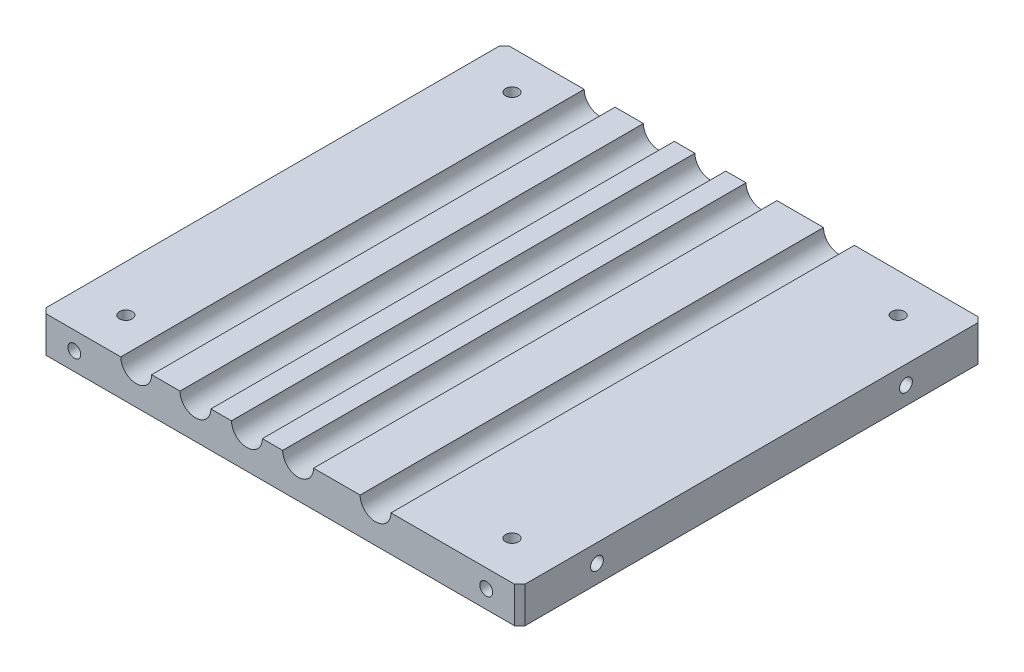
ISO-10303-21;
HEADER;
FILE_DESCRIPTION(('STEP AP214'),'2;1');
FILE_NAME('part.step','',(''),(''),'','','');
FILE_SCHEMA(('AUTOMOTIVE_DESIGN { 1 0 10303 214 1 1 1 1 }'));
ENDSEC;
DATA;
#1=APPLICATION_CONTEXT('core data for automotive mechanical design processes');
#2=APPLICATION_PROTOCOL_DEFINITION('international standard','automotive_design',2000,#1);
#3=PRODUCT_CONTEXT('',#1,'mechanical');
#4=PRODUCT('Part','Part','',(#3));
#5=PRODUCT_RELATED_PRODUCT_CATEGORY('part','',(#4));
#6=PRODUCT_DEFINITION_FORMATION('','',#4);
#7=PRODUCT_DEFINITION_CONTEXT('part definition',#1,'design');
#8=PRODUCT_DEFINITION('design','',#6,#7);
#9=PRODUCT_DEFINITION_SHAPE('','',#8);
#10=(LENGTH_UNIT() NAMED_UNIT(*) SI_UNIT(.MILLI.,.METRE.));
#11=(NAMED_UNIT(*) PLANE_ANGLE_UNIT() SI_UNIT($,.RADIAN.));
#12=(NAMED_UNIT(*) SI_UNIT($,.STERADIAN.) SOLID_ANGLE_UNIT());
#13=UNCERTAINTY_MEASURE_WITH_UNIT(LENGTH_MEASURE(1.E-05),#10,'distance_accuracy_value','');
#14=(GEOMETRIC_REPRESENTATION_CONTEXT(3) GLOBAL_UNCERTAINTY_ASSIGNED_CONTEXT((#13)) GLOBAL_UNIT_ASSIGNED_CONTEXT((#10,
#11,#12)) REPRESENTATION_CONTEXT('',''));
#15=CARTESIAN_POINT('',(0.,0.,0.));
#16=DIRECTION('',(0.,0.,1.));
#17=DIRECTION('',(1.,0.,0.));
#18=AXIS2_PLACEMENT_3D('',#15,#16,#17);
#19=CARTESIAN_POINT('',(0.,0.,0.));
#20=DIRECTION('',(0.,1.,0.));
#21=DIRECTION('',(0.,0.,1.));
#22=AXIS2_PLACEMENT_3D('',#19,#20,#21);
#23=PLANE('',#22);
#24=CARTESIAN_POINT('',(-37.5,0.,-37.5));
#25=DIRECTION('',(0.,-1.,0.));
#26=DIRECTION('',(0.,0.,-1.));
#27=AXIS2_PLACEMENT_3D('',#24,#25,#26);
#28=CIRCLE('',#27,1.24999999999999);
#29=CARTESIAN_POINT('',(-37.5,0.,-38.75));
#30=VERTEX_POINT('',#29);
#31=EDGE_CURVE('E263',#30,#30,#28,.T.);
#32=ORIENTED_EDGE('',*,*,#31,.F.);
#33=EDGE_LOOP('',(#32));
#34=FACE_BOUND('',#33,.T.);
#35=CARTESIAN_POINT('',(37.5,0.,-37.5));
#36=DIRECTION('',(0.,-1.,0.));
#37=DIRECTION('',(0.,0.,-1.));
#38=AXIS2_PLACEMENT_3D('',#35,#36,#37);
#39=CIRCLE('',#38,1.24999999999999);
#40=CARTESIAN_POINT('',(37.5,0.,-38.75));
#41=VERTEX_POINT('',#40);
#42=EDGE_CURVE('E271',#41,#41,#39,.T.);
#43=ORIENTED_EDGE('',*,*,#42,.F.);
#44=EDGE_LOOP('',(#43));
#45=FACE_BOUND('',#44,.T.);
#46=CARTESIAN_POINT('',(37.5,0.,37.5));
#47=DIRECTION('',(0.,-1.,0.));
#48=DIRECTION('',(0.,0.,-1.));
#49=AXIS2_PLACEMENT_3D('',#46,#47,#48);
#50=CIRCLE('',#49,1.24999999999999);
#51=CARTESIAN_POINT('',(37.5,0.,36.25));
#52=VERTEX_POINT('',#51);
#53=EDGE_CURVE('E279',#52,#52,#50,.T.);
#54=ORIENTED_EDGE('',*,*,#53,.F.);
#55=EDGE_LOOP('',(#54));
#56=FACE_BOUND('',#55,.T.);
#57=DIRECTION('',(-1.,0.,0.));
#58=VECTOR('',#57,1.);
#59=CARTESIAN_POINT('',(-46.5,0.,-45.));
#60=LINE('',#59,#58);
#61=CARTESIAN_POINT('',(45.5,0.,-45.));
#62=VERTEX_POINT('',#61);
#63=CARTESIAN_POINT('',(-45.5,0.,-45.));
#64=VERTEX_POINT('',#63);
#65=EDGE_CURVE('E367',#62,#64,#60,.T.);
#66=ORIENTED_EDGE('',*,*,#65,.F.);
#67=DIRECTION('',(-0.707106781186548,0.,-0.707106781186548));
#68=VECTOR('',#67,1.);
#69=CARTESIAN_POINT('',(45.5,0.,-45.));
#70=LINE('',#69,#68);
#71=CARTESIAN_POINT('',(46.5,0.,-44.));
#72=VERTEX_POINT('',#71);
#73=EDGE_CURVE('E394',#62,#72,#70,.F.);
#74=ORIENTED_EDGE('',*,*,#73,.T.);
#75=DIRECTION('',(0.,0.,-1.));
#76=VECTOR('',#75,1.);
#77=CARTESIAN_POINT('',(46.5,0.,-45.));
#78=LINE('',#77,#76);
#79=CARTESIAN_POINT('',(46.5,0.,44.));
#80=VERTEX_POINT('',#79);
#81=EDGE_CURVE('E338',#80,#72,#78,.T.);
#82=ORIENTED_EDGE('',*,*,#81,.F.);
#83=DIRECTION('',(0.707106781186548,0.,-0.707106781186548));
#84=VECTOR('',#83,1.);
#85=CARTESIAN_POINT('',(46.5,0.,44.));
#86=LINE('',#85,#84);
#87=CARTESIAN_POINT('',(45.5,0.,45.));
#88=VERTEX_POINT('',#87);
#89=EDGE_CURVE('E385',#80,#88,#86,.F.);
#90=ORIENTED_EDGE('',*,*,#89,.T.);
#91=DIRECTION('',(1.,0.,0.));
#92=VECTOR('',#91,1.);
#93=CARTESIAN_POINT('',(-46.5,0.,45.));
#94=LINE('',#93,#92);
#95=CARTESIAN_POINT('',(-45.5,0.,45.));
#96=VERTEX_POINT('',#95);
#97=EDGE_CURVE('E346',#96,#88,#94,.T.);
#98=ORIENTED_EDGE('',*,*,#97,.F.);
#99=DIRECTION('',(0.707106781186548,0.,0.707106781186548));
#100=VECTOR('',#99,1.);
#101=CARTESIAN_POINT('',(-45.5,0.,45.));
#102=LINE('',#101,#100);
#103=CARTESIAN_POINT('',(-46.5,0.,44.));
#104=VERTEX_POINT('',#103);
#105=EDGE_CURVE('E388',#96,#104,#102,.F.);
#106=ORIENTED_EDGE('',*,*,#105,.T.);
#107=DIRECTION('',(0.,0.,1.));
#108=VECTOR('',#107,1.);
#109=CARTESIAN_POINT('',(-46.5,0.,-45.));
#110=LINE('',#109,#108);
#111=CARTESIAN_POINT('',(-46.5,0.,-44.));
#112=VERTEX_POINT('',#111);
#113=EDGE_CURVE('E371',#112,#104,#110,.T.);
#114=ORIENTED_EDGE('',*,*,#113,.F.);
#115=DIRECTION('',(-0.707106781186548,0.,0.707106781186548));
#116=VECTOR('',#115,1.);
#117=CARTESIAN_POINT('',(-46.5,0.,-44.));
#118=LINE('',#117,#116);
#119=EDGE_CURVE('E391',#112,#64,#118,.F.);
#120=ORIENTED_EDGE('',*,*,#119,.T.);
#121=EDGE_LOOP('',(#66,#74,#82,#90,#98,#106,#114,#120));
#122=FACE_BOUND('',#121,.T.);
#123=CARTESIAN_POINT('',(-37.5,0.,37.5));
#124=DIRECTION('',(0.,-1.,0.));
#125=DIRECTION('',(0.,0.,-1.));
#126=AXIS2_PLACEMENT_3D('',#123,#124,#125);
#127=CIRCLE('',#126,1.24999999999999);
#128=CARTESIAN_POINT('',(-37.5,0.,36.25));
#129=VERTEX_POINT('',#128);
#130=EDGE_CURVE('E287',#129,#129,#127,.T.);
#131=ORIENTED_EDGE('',*,*,#130,.F.);
#132=EDGE_LOOP('',(#131));
#133=FACE_BOUND('',#132,.T.);
#134=ADVANCED_FACE('F42',(#34,#45,#56,#122,#133),#23,.F.);
#135=CARTESIAN_POINT('',(0.,7.,0.));
#136=DIRECTION('',(0.,1.,0.));
#137=DIRECTION('',(0.,0.,1.));
#138=AXIS2_PLACEMENT_3D('',#135,#136,#137);
#139=PLANE('',#138);
#140=DIRECTION('',(0.,0.,1.));
#141=VECTOR('',#140,1.);
#142=CARTESIAN_POINT('',(0.459737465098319,7.,-45.));
#143=LINE('',#142,#141);
#144=CARTESIAN_POINT('',(0.459737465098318,7.,-45.));
#145=VERTEX_POINT('',#144);
#146=CARTESIAN_POINT('',(0.459737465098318,7.,45.));
#147=VERTEX_POINT('',#146);
#148=EDGE_CURVE('E58',#145,#147,#143,.T.);
#149=ORIENTED_EDGE('',*,*,#148,.F.);
#150=DIRECTION('',(-1.,0.,0.));
#151=VECTOR('',#150,1.);
#152=CARTESIAN_POINT('',(-46.5,7.,-45.));
#153=LINE('',#152,#151);
#154=CARTESIAN_POINT('',(-3.48000000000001,7.,-45.));
#155=VERTEX_POINT('',#154);
#156=EDGE_CURVE('E503',#145,#155,#153,.T.);
#157=ORIENTED_EDGE('',*,*,#156,.T.);
#158=DIRECTION('',(0.,0.,1.));
#159=VECTOR('',#158,1.);
#160=CARTESIAN_POINT('',(-3.48000000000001,7.,-45.));
#161=LINE('',#160,#159);
#162=CARTESIAN_POINT('',(-3.48000000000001,7.,45.));
#163=VERTEX_POINT('',#162);
#164=EDGE_CURVE('E323',#163,#155,#161,.F.);
#165=ORIENTED_EDGE('',*,*,#164,.F.);
#166=DIRECTION('',(1.,0.,0.));
#167=VECTOR('',#166,1.);
#168=CARTESIAN_POINT('',(-46.5,7.,45.));
#169=LINE('',#168,#167);
#170=EDGE_CURVE('E454',#163,#147,#169,.T.);
#171=ORIENTED_EDGE('',*,*,#170,.T.);
#172=EDGE_LOOP('',(#149,#157,#165,#171));
#173=FACE_BOUND('',#172,.T.);
#174=ADVANCED_FACE('F551',(#173),#139,.T.);
#175=DIRECTION('',(0.,0.,1.));
#176=VECTOR('',#175,1.);
#177=CARTESIAN_POINT('',(-9.48000000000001,7.,-45.));
#178=LINE('',#177,#176);
#179=CARTESIAN_POINT('',(-9.48000000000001,7.,-45.));
#180=VERTEX_POINT('',#179);
#181=CARTESIAN_POINT('',(-9.48000000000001,7.,45.));
#182=VERTEX_POINT('',#181);
#183=EDGE_CURVE('E65',#180,#182,#178,.T.);
#184=ORIENTED_EDGE('',*,*,#183,.F.);
#185=CARTESIAN_POINT('',(-13.48,7.,-45.));
#186=VERTEX_POINT('',#185);
#187=EDGE_CURVE('E506',#180,#186,#153,.T.);
#188=ORIENTED_EDGE('',*,*,#187,.T.);
#189=DIRECTION('',(0.,0.,1.));
#190=VECTOR('',#189,1.);
#191=CARTESIAN_POINT('',(-13.48,7.,-45.));
#192=LINE('',#191,#190);
#193=CARTESIAN_POINT('',(-13.48,7.,45.));
#194=VERTEX_POINT('',#193);
#195=EDGE_CURVE('E317',#194,#186,#192,.F.);
#196=ORIENTED_EDGE('',*,*,#195,.F.);
#197=EDGE_CURVE('E452',#194,#182,#169,.T.);
#198=ORIENTED_EDGE('',*,*,#197,.T.);
#199=EDGE_LOOP('',(#184,#188,#196,#198));
#200=FACE_BOUND('',#199,.T.);
#201=ADVANCED_FACE('F458',(#200),#139,.T.);
#202=DIRECTION('',(0.,0.,1.));
#203=VECTOR('',#202,1.);
#204=CARTESIAN_POINT('',(-19.48,7.,-45.));
#205=LINE('',#204,#203);
#206=CARTESIAN_POINT('',(-19.48,7.,-45.));
#207=VERTEX_POINT('',#206);
#208=CARTESIAN_POINT('',(-19.48,7.,45.));
#209=VERTEX_POINT('',#208);
#210=EDGE_CURVE('E320',#207,#209,#205,.T.);
#211=ORIENTED_EDGE('',*,*,#210,.F.);
#212=CARTESIAN_POINT('',(-24.9800000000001,7.,-45.));
#213=VERTEX_POINT('',#212);
#214=EDGE_CURVE('E508',#207,#213,#153,.T.);
#215=ORIENTED_EDGE('',*,*,#214,.T.);
#216=DIRECTION('',(0.,0.,1.));
#217=VECTOR('',#216,1.);
#218=CARTESIAN_POINT('',(-24.9800000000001,7.,-45.));
#219=LINE('',#218,#217);
#220=CARTESIAN_POINT('',(-24.9800000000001,7.,45.));
#221=VERTEX_POINT('',#220);
#222=EDGE_CURVE('E300',#221,#213,#219,.F.);
#223=ORIENTED_EDGE('',*,*,#222,.F.);
#224=EDGE_CURVE('E362',#221,#209,#169,.T.);
#225=ORIENTED_EDGE('',*,*,#224,.T.);
#226=EDGE_LOOP('',(#211,#215,#223,#225));
#227=FACE_BOUND('',#226,.T.);
#228=ADVANCED_FACE('F537',(#227),#139,.T.);
#229=CARTESIAN_POINT('',(-37.5,7.,-37.5));
#230=DIRECTION('',(0.,-1.,0.));
#231=DIRECTION('',(0.,0.,-1.));
#232=AXIS2_PLACEMENT_3D('',#229,#230,#231);
#233=CIRCLE('',#232,1.25);
#234=CARTESIAN_POINT('',(-37.5,7.,-38.75));
#235=VERTEX_POINT('',#234);
#236=EDGE_CURVE('E267',#235,#235,#233,.T.);
#237=ORIENTED_EDGE('',*,*,#236,.T.);
#238=EDGE_LOOP('',(#237));
#239=FACE_BOUND('',#238,.T.);
#240=CARTESIAN_POINT('',(-37.5,7.,37.5));
#241=DIRECTION('',(0.,-1.,0.));
#242=DIRECTION('',(0.,0.,-1.));
#243=AXIS2_PLACEMENT_3D('',#240,#241,#242);
#244=CIRCLE('',#243,1.25);
#245=CARTESIAN_POINT('',(-37.5,7.,36.25));
#246=VERTEX_POINT('',#245);
#247=EDGE_CURVE('E291',#246,#246,#244,.T.);
#248=ORIENTED_EDGE('',*,*,#247,.T.);
#249=EDGE_LOOP('',(#248));
#250=FACE_BOUND('',#249,.T.);
#251=DIRECTION('',(0.,0.,1.));
#252=VECTOR('',#251,1.);
#253=CARTESIAN_POINT('',(-30.9800000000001,7.,-45.));
#254=LINE('',#253,#252);
#255=CARTESIAN_POINT('',(-30.9800000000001,7.,-45.));
#256=VERTEX_POINT('',#255);
#257=CARTESIAN_POINT('',(-30.9800000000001,7.,45.));
#258=VERTEX_POINT('',#257);
#259=EDGE_CURVE('E314',#256,#258,#254,.T.);
#260=ORIENTED_EDGE('',*,*,#259,.F.);
#261=CARTESIAN_POINT('',(-45.5,7.,-45.));
#262=VERTEX_POINT('',#261);
#263=EDGE_CURVE('E345',#256,#262,#153,.T.);
#264=ORIENTED_EDGE('',*,*,#263,.T.);
#265=DIRECTION('',(0.707106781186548,0.,-0.707106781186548));
#266=VECTOR('',#265,1.);
#267=CARTESIAN_POINT('',(-45.25,7.,-45.25));
#268=LINE('',#267,#266);
#269=CARTESIAN_POINT('',(-46.5,7.,-44.));
#270=VERTEX_POINT('',#269);
#271=EDGE_CURVE('E410',#262,#270,#268,.F.);
#272=ORIENTED_EDGE('',*,*,#271,.T.);
#273=DIRECTION('',(0.,0.,1.));
#274=VECTOR('',#273,1.);
#275=CARTESIAN_POINT('',(-46.5,7.,-45.));
#276=LINE('',#275,#274);
#277=CARTESIAN_POINT('',(-46.5,7.,44.));
#278=VERTEX_POINT('',#277);
#279=EDGE_CURVE('E351',#270,#278,#276,.T.);
#280=ORIENTED_EDGE('',*,*,#279,.T.);
#281=DIRECTION('',(-0.707106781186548,0.,-0.707106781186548));
#282=VECTOR('',#281,1.);
#283=CARTESIAN_POINT('',(-45.25,7.,45.25));
#284=LINE('',#283,#282);
#285=CARTESIAN_POINT('',(-45.5,7.,45.));
#286=VERTEX_POINT('',#285);
#287=EDGE_CURVE('E407',#278,#286,#284,.F.);
#288=ORIENTED_EDGE('',*,*,#287,.T.);
#289=EDGE_CURVE('E357',#286,#258,#169,.T.);
#290=ORIENTED_EDGE('',*,*,#289,.T.);
#291=EDGE_LOOP('',(#260,#264,#272,#280,#288,#290));
#292=FACE_BOUND('',#291,.T.);
#293=ADVANCED_FACE('F519',(#239,#250,#292),#139,.T.);
#294=DIRECTION('',(0.,0.,1.));
#295=VECTOR('',#294,1.);
#296=CARTESIAN_POINT('',(6.45964438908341,7.,-45.));
#297=LINE('',#296,#295);
#298=CARTESIAN_POINT('',(6.45964438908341,7.,45.));
#299=VERTEX_POINT('',#298);
#300=CARTESIAN_POINT('',(6.45964438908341,7.,-45.));
#301=VERTEX_POINT('',#300);
#302=EDGE_CURVE('E328',#299,#301,#297,.F.);
#303=ORIENTED_EDGE('',*,*,#302,.F.);
#304=CARTESIAN_POINT('',(15.493876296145,7.,45.));
#305=VERTEX_POINT('',#304);
#306=EDGE_CURVE('E363',#299,#305,#169,.T.);
#307=ORIENTED_EDGE('',*,*,#306,.T.);
#308=DIRECTION('',(0.,0.,1.));
#309=VECTOR('',#308,1.);
#310=CARTESIAN_POINT('',(15.493876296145,7.,-45.));
#311=LINE('',#310,#309);
#312=CARTESIAN_POINT('',(15.493876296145,7.,-45.));
#313=VERTEX_POINT('',#312);
#314=EDGE_CURVE('E434',#313,#305,#311,.T.);
#315=ORIENTED_EDGE('',*,*,#314,.F.);
#316=EDGE_CURVE('E352',#313,#301,#153,.T.);
#317=ORIENTED_EDGE('',*,*,#316,.T.);
#318=EDGE_LOOP('',(#303,#307,#315,#317));
#319=FACE_BOUND('',#318,.T.);
#320=ADVANCED_FACE('F501',(#319),#139,.T.);
#321=CARTESIAN_POINT('',(46.5,7.,-45.));
#322=DIRECTION('',(-1.,0.,0.));
#323=DIRECTION('',(0.,0.,1.));
#324=AXIS2_PLACEMENT_3D('',#321,#322,#323);
#325=PLANE('',#324);
#326=CARTESIAN_POINT('',(46.5,3.50000000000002,-30.));
#327=DIRECTION('',(1.,0.,0.));
#328=DIRECTION('',(0.,0.,-1.));
#329=AXIS2_PLACEMENT_3D('',#326,#327,#328);
#330=CIRCLE('',#329,1.24999999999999);
#331=CARTESIAN_POINT('',(46.5,3.50000000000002,-31.25));
#332=VERTEX_POINT('',#331);
#333=EDGE_CURVE('E247',#332,#332,#330,.T.);
#334=ORIENTED_EDGE('',*,*,#333,.F.);
#335=EDGE_LOOP('',(#334));
#336=FACE_BOUND('',#335,.T.);
#337=CARTESIAN_POINT('',(46.5,3.50000000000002,30.));
#338=DIRECTION('',(1.,0.,0.));
#339=DIRECTION('',(0.,0.,-1.));
#340=AXIS2_PLACEMENT_3D('',#337,#338,#339);
#341=CIRCLE('',#340,1.24999999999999);
#342=CARTESIAN_POINT('',(46.5,3.50000000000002,28.75));
#343=VERTEX_POINT('',#342);
#344=EDGE_CURVE('E255',#343,#343,#341,.T.);
#345=ORIENTED_EDGE('',*,*,#344,.F.);
#346=EDGE_LOOP('',(#345));
#347=FACE_BOUND('',#346,.T.);
#348=ORIENTED_EDGE('',*,*,#81,.T.);
#349=DIRECTION('',(0.,1.,0.));
#350=VECTOR('',#349,1.);
#351=CARTESIAN_POINT('',(46.5,7.,-44.));
#352=LINE('',#351,#350);
#353=CARTESIAN_POINT('',(46.5,7.,-44.));
#354=VERTEX_POINT('',#353);
#355=EDGE_CURVE('E401',#72,#354,#352,.T.);
#356=ORIENTED_EDGE('',*,*,#355,.T.);
#357=DIRECTION('',(0.,0.,-1.));
#358=VECTOR('',#357,1.);
#359=CARTESIAN_POINT('',(46.5,7.,-45.));
#360=LINE('',#359,#358);
#361=CARTESIAN_POINT('',(46.5,7.,44.));
#362=VERTEX_POINT('',#361);
#363=EDGE_CURVE('E341',#362,#354,#360,.T.);
#364=ORIENTED_EDGE('',*,*,#363,.F.);
#365=DIRECTION('',(0.,-1.,0.));
#366=VECTOR('',#365,1.);
#367=CARTESIAN_POINT('',(46.5,7.,44.));
#368=LINE('',#367,#366);
#369=EDGE_CURVE('E397',#362,#80,#368,.T.);
#370=ORIENTED_EDGE('',*,*,#369,.T.);
#371=EDGE_LOOP('',(#348,#356,#364,#370));
#372=FACE_BOUND('',#371,.T.);
#373=ADVANCED_FACE('F483',(#336,#347,#372),#325,.F.);
#374=CARTESIAN_POINT('',(-46.5,7.,-45.));
#375=DIRECTION('',(0.,0.,1.));
#376=DIRECTION('',(1.,0.,0.));
#377=AXIS2_PLACEMENT_3D('',#374,#375,#376);
#378=PLANE('',#377);
#379=CARTESIAN_POINT('',(-40.,3.5,-45.));
#380=DIRECTION('',(0.,0.,-1.));
#381=DIRECTION('',(-1.,0.,0.));
#382=AXIS2_PLACEMENT_3D('',#379,#380,#381);
#383=CIRCLE('',#382,1.24999999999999);
#384=CARTESIAN_POINT('',(-41.25,3.5,-45.));
#385=VERTEX_POINT('',#384);
#386=EDGE_CURVE('E216',#385,#385,#383,.T.);
#387=ORIENTED_EDGE('',*,*,#386,.F.);
#388=EDGE_LOOP('',(#387));
#389=FACE_BOUND('',#388,.T.);
#390=CARTESIAN_POINT('',(40.,3.5,-45.));
#391=DIRECTION('',(0.,0.,-1.));
#392=DIRECTION('',(-1.,0.,0.));
#393=AXIS2_PLACEMENT_3D('',#390,#391,#392);
#394=CIRCLE('',#393,1.24999999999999);
#395=CARTESIAN_POINT('',(38.75,3.5,-45.));
#396=VERTEX_POINT('',#395);
#397=EDGE_CURVE('E224',#396,#396,#394,.T.);
#398=ORIENTED_EDGE('',*,*,#397,.F.);
#399=EDGE_LOOP('',(#398));
#400=FACE_BOUND('',#399,.T.);
#401=ORIENTED_EDGE('',*,*,#156,.F.);
#402=CARTESIAN_POINT('',(3.45969092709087,6.98328994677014,-45.));
#403=DIRECTION('',(0.,0.,1.));
#404=DIRECTION('',(1.,0.,0.));
#405=AXIS2_PLACEMENT_3D('',#402,#403,#404);
#406=CIRCLE('',#405,3.);
#407=EDGE_CURVE('E296',#145,#301,#406,.T.);
#408=ORIENTED_EDGE('',*,*,#407,.T.);
#409=ORIENTED_EDGE('',*,*,#316,.F.);
#410=CARTESIAN_POINT('',(18.493876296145,7.00000000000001,-45.));
#411=DIRECTION('',(0.,0.,1.));
#412=DIRECTION('',(1.,0.,0.));
#413=AXIS2_PLACEMENT_3D('',#410,#411,#412);
#414=CIRCLE('',#413,3.);
#415=CARTESIAN_POINT('',(21.493876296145,7.,-45.));
#416=VERTEX_POINT('',#415);
#417=EDGE_CURVE('E334',#313,#416,#414,.T.);
#418=ORIENTED_EDGE('',*,*,#417,.T.);
#419=CARTESIAN_POINT('',(45.5,7.,-45.));
#420=VERTEX_POINT('',#419);
#421=EDGE_CURVE('E347',#420,#416,#153,.T.);
#422=ORIENTED_EDGE('',*,*,#421,.F.);
#423=DIRECTION('',(0.,-1.,0.));
#424=VECTOR('',#423,1.);
#425=CARTESIAN_POINT('',(45.5,7.,-45.));
#426=LINE('',#425,#424);
#427=EDGE_CURVE('E381',#420,#62,#426,.T.);
#428=ORIENTED_EDGE('',*,*,#427,.T.);
#429=ORIENTED_EDGE('',*,*,#65,.T.);
#430=DIRECTION('',(0.,1.,0.));
#431=VECTOR('',#430,1.);
#432=CARTESIAN_POINT('',(-45.5,7.,-45.));
#433=LINE('',#432,#431);
#434=EDGE_CURVE('E361',#64,#262,#433,.T.);
#435=ORIENTED_EDGE('',*,*,#434,.T.);
#436=ORIENTED_EDGE('',*,*,#263,.F.);
#437=CARTESIAN_POINT('',(-27.9800000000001,6.99999999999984,-45.));
#438=DIRECTION('',(0.,0.,1.));
#439=DIRECTION('',(1.,0.,0.));
#440=AXIS2_PLACEMENT_3D('',#437,#438,#439);
#441=CIRCLE('',#440,3.);
#442=EDGE_CURVE('E295',#256,#213,#441,.T.);
#443=ORIENTED_EDGE('',*,*,#442,.T.);
#444=ORIENTED_EDGE('',*,*,#214,.F.);
#445=CARTESIAN_POINT('',(-16.48,6.99999999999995,-45.));
#446=DIRECTION('',(0.,0.,1.));
#447=DIRECTION('',(1.,0.,0.));
#448=AXIS2_PLACEMENT_3D('',#445,#446,#447);
#449=CIRCLE('',#448,3.);
#450=EDGE_CURVE('E305',#207,#186,#449,.T.);
#451=ORIENTED_EDGE('',*,*,#450,.T.);
#452=ORIENTED_EDGE('',*,*,#187,.F.);
#453=CARTESIAN_POINT('',(-6.48000000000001,6.99999999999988,-45.));
#454=DIRECTION('',(0.,0.,1.));
#455=DIRECTION('',(1.,0.,0.));
#456=AXIS2_PLACEMENT_3D('',#453,#454,#455);
#457=CIRCLE('',#456,3.);
#458=EDGE_CURVE('E301',#180,#155,#457,.T.);
#459=ORIENTED_EDGE('',*,*,#458,.T.);
#460=EDGE_LOOP('',(#401,#408,#409,#418,#422,#428,#429,#435,#436,#443,#444,#451,#452,#459));
#461=FACE_BOUND('',#460,.T.);
#462=ADVANCED_FACE('F495',(#389,#400,#461),#378,.F.);
#463=CARTESIAN_POINT('',(-46.5,7.,-45.));
#464=DIRECTION('',(1.,0.,0.));
#465=DIRECTION('',(0.,0.,-1.));
#466=AXIS2_PLACEMENT_3D('',#463,#464,#465);
#467=PLANE('',#466);
#468=CARTESIAN_POINT('',(-46.5,3.5,30.));
#469=DIRECTION('',(-1.,0.,0.));
#470=DIRECTION('',(0.,0.,1.));
#471=AXIS2_PLACEMENT_3D('',#468,#469,#470);
#472=CIRCLE('',#471,1.24999999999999);
#473=CARTESIAN_POINT('',(-46.5,3.5,31.25));
#474=VERTEX_POINT('',#473);
#475=EDGE_CURVE('E232',#474,#474,#472,.T.);
#476=ORIENTED_EDGE('',*,*,#475,.F.);
#477=EDGE_LOOP('',(#476));
#478=FACE_BOUND('',#477,.T.);
#479=CARTESIAN_POINT('',(-46.5,3.5,-30.));
#480=DIRECTION('',(-1.,0.,0.));
#481=DIRECTION('',(0.,0.,1.));
#482=AXIS2_PLACEMENT_3D('',#479,#480,#481);
#483=CIRCLE('',#482,1.24999999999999);
#484=CARTESIAN_POINT('',(-46.5,3.5,-28.75));
#485=VERTEX_POINT('',#484);
#486=EDGE_CURVE('E240',#485,#485,#483,.T.);
#487=ORIENTED_EDGE('',*,*,#486,.F.);
#488=EDGE_LOOP('',(#487));
#489=FACE_BOUND('',#488,.T.);
#490=ORIENTED_EDGE('',*,*,#279,.F.);
#491=DIRECTION('',(0.,-1.,0.));
#492=VECTOR('',#491,1.);
#493=CARTESIAN_POINT('',(-46.5,7.,-44.));
#494=LINE('',#493,#492);
#495=EDGE_CURVE('E419',#270,#112,#494,.T.);
#496=ORIENTED_EDGE('',*,*,#495,.T.);
#497=ORIENTED_EDGE('',*,*,#113,.T.);
#498=DIRECTION('',(0.,1.,0.));
#499=VECTOR('',#498,1.);
#500=CARTESIAN_POINT('',(-46.5,7.,44.));
#501=LINE('',#500,#499);
#502=EDGE_CURVE('E416',#104,#278,#501,.T.);
#503=ORIENTED_EDGE('',*,*,#502,.T.);
#504=EDGE_LOOP('',(#490,#496,#497,#503));
#505=FACE_BOUND('',#504,.T.);
#506=ADVANCED_FACE('F527',(#478,#489,#505),#467,.F.);
#507=CARTESIAN_POINT('',(-46.5,7.,45.));
#508=DIRECTION('',(0.,0.,-1.));
#509=DIRECTION('',(-1.,0.,0.));
#510=AXIS2_PLACEMENT_3D('',#507,#508,#509);
#511=PLANE('',#510);
#512=CARTESIAN_POINT('',(40.,3.5,45.));
#513=DIRECTION('',(0.,0.,1.));
#514=DIRECTION('',(1.,0.,0.));
#515=AXIS2_PLACEMENT_3D('',#512,#513,#514);
#516=CIRCLE('',#515,1.24999999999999);
#517=CARTESIAN_POINT('',(41.25,3.5,45.));
#518=VERTEX_POINT('',#517);
#519=EDGE_CURVE('E201',#518,#518,#516,.T.);
#520=ORIENTED_EDGE('',*,*,#519,.F.);
#521=EDGE_LOOP('',(#520));
#522=FACE_BOUND('',#521,.T.);
#523=CARTESIAN_POINT('',(-40.,3.5,45.));
#524=DIRECTION('',(0.,0.,1.));
#525=DIRECTION('',(1.,0.,0.));
#526=AXIS2_PLACEMENT_3D('',#523,#524,#525);
#527=CIRCLE('',#526,1.24999999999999);
#528=CARTESIAN_POINT('',(-38.75,3.5,45.));
#529=VERTEX_POINT('',#528);
#530=EDGE_CURVE('E200',#529,#529,#527,.T.);
#531=ORIENTED_EDGE('',*,*,#530,.F.);
#532=EDGE_LOOP('',(#531));
#533=FACE_BOUND('',#532,.T.);
#534=ORIENTED_EDGE('',*,*,#306,.F.);
#535=CARTESIAN_POINT('',(3.45969092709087,6.98328994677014,45.));
#536=DIRECTION('',(0.,0.,-1.));
#537=DIRECTION('',(-1.,0.,0.));
#538=AXIS2_PLACEMENT_3D('',#535,#536,#537);
#539=CIRCLE('',#538,3.);
#540=EDGE_CURVE('E11',#299,#147,#539,.T.);
#541=ORIENTED_EDGE('',*,*,#540,.T.);
#542=ORIENTED_EDGE('',*,*,#170,.F.);
#543=CARTESIAN_POINT('',(-6.48000000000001,6.99999999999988,45.));
#544=DIRECTION('',(0.,0.,-1.));
#545=DIRECTION('',(-1.,0.,0.));
#546=AXIS2_PLACEMENT_3D('',#543,#544,#545);
#547=CIRCLE('',#546,3.);
#548=EDGE_CURVE('E51',#163,#182,#547,.T.);
#549=ORIENTED_EDGE('',*,*,#548,.T.);
#550=ORIENTED_EDGE('',*,*,#197,.F.);
#551=CARTESIAN_POINT('',(-16.48,6.99999999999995,45.));
#552=DIRECTION('',(0.,0.,-1.));
#553=DIRECTION('',(-1.,0.,0.));
#554=AXIS2_PLACEMENT_3D('',#551,#552,#553);
#555=CIRCLE('',#554,3.);
#556=EDGE_CURVE('E442',#194,#209,#555,.T.);
#557=ORIENTED_EDGE('',*,*,#556,.T.);
#558=ORIENTED_EDGE('',*,*,#224,.F.);
#559=CARTESIAN_POINT('',(-27.9800000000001,6.99999999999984,45.));
#560=DIRECTION('',(0.,0.,-1.));
#561=DIRECTION('',(-1.,0.,0.));
#562=AXIS2_PLACEMENT_3D('',#559,#560,#561);
#563=CIRCLE('',#562,3.);
#564=EDGE_CURVE('E438',#221,#258,#563,.T.);
#565=ORIENTED_EDGE('',*,*,#564,.T.);
#566=ORIENTED_EDGE('',*,*,#289,.F.);
#567=DIRECTION('',(0.,-1.,0.));
#568=VECTOR('',#567,1.);
#569=CARTESIAN_POINT('',(-45.5,7.,45.));
#570=LINE('',#569,#568);
#571=EDGE_CURVE('E427',#286,#96,#570,.T.);
#572=ORIENTED_EDGE('',*,*,#571,.T.);
#573=ORIENTED_EDGE('',*,*,#97,.T.);
#574=DIRECTION('',(0.,1.,0.));
#575=VECTOR('',#574,1.);
#576=CARTESIAN_POINT('',(45.5,7.,45.));
#577=LINE('',#576,#575);
#578=CARTESIAN_POINT('',(45.5,7.,45.));
#579=VERTEX_POINT('',#578);
#580=EDGE_CURVE('E423',#88,#579,#577,.T.);
#581=ORIENTED_EDGE('',*,*,#580,.T.);
#582=CARTESIAN_POINT('',(21.493876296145,7.,45.));
#583=VERTEX_POINT('',#582);
#584=EDGE_CURVE('E356',#583,#579,#169,.T.);
#585=ORIENTED_EDGE('',*,*,#584,.F.);
#586=CARTESIAN_POINT('',(18.493876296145,7.00000000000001,45.));
#587=DIRECTION('',(0.,0.,1.));
#588=DIRECTION('',(1.,0.,0.));
#589=AXIS2_PLACEMENT_3D('',#586,#587,#588);
#590=CIRCLE('',#589,3.);
#591=EDGE_CURVE('E333',#305,#583,#590,.T.);
#592=ORIENTED_EDGE('',*,*,#591,.F.);
#593=EDGE_LOOP('',(#534,#541,#542,#549,#550,#557,#558,#565,#566,#572,#573,#581,#585,#592));
#594=FACE_BOUND('',#593,.T.);
#595=ADVANCED_FACE('F451',(#522,#533,#594),#511,.F.);
#596=CARTESIAN_POINT('',(37.5,7.,-37.5));
#597=DIRECTION('',(0.,-1.,0.));
#598=DIRECTION('',(0.,0.,-1.));
#599=AXIS2_PLACEMENT_3D('',#596,#597,#598);
#600=CIRCLE('',#599,1.25);
#601=CARTESIAN_POINT('',(37.5,7.,-38.75));
#602=VERTEX_POINT('',#601);
#603=EDGE_CURVE('E275',#602,#602,#600,.T.);
#604=ORIENTED_EDGE('',*,*,#603,.T.);
#605=EDGE_LOOP('',(#604));
#606=FACE_BOUND('',#605,.T.);
#607=CARTESIAN_POINT('',(37.5,7.,37.5));
#608=DIRECTION('',(0.,-1.,0.));
#609=DIRECTION('',(0.,0.,-1.));
#610=AXIS2_PLACEMENT_3D('',#607,#608,#609);
#611=CIRCLE('',#610,1.25);
#612=CARTESIAN_POINT('',(37.5,7.,36.25));
#613=VERTEX_POINT('',#612);
#614=EDGE_CURVE('E283',#613,#613,#611,.T.);
#615=ORIENTED_EDGE('',*,*,#614,.T.);
#616=EDGE_LOOP('',(#615));
#617=FACE_BOUND('',#616,.T.);
#618=DIRECTION('',(0.,0.,1.));
#619=VECTOR('',#618,1.);
#620=CARTESIAN_POINT('',(21.493876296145,7.,-45.));
#621=LINE('',#620,#619);
#622=EDGE_CURVE('E431',#583,#416,#621,.F.);
#623=ORIENTED_EDGE('',*,*,#622,.F.);
#624=ORIENTED_EDGE('',*,*,#584,.T.);
#625=DIRECTION('',(-0.707106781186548,0.,0.707106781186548));
#626=VECTOR('',#625,1.);
#627=CARTESIAN_POINT('',(45.25,7.,45.25));
#628=LINE('',#627,#626);
#629=EDGE_CURVE('E404',#579,#362,#628,.F.);
#630=ORIENTED_EDGE('',*,*,#629,.T.);
#631=ORIENTED_EDGE('',*,*,#363,.T.);
#632=DIRECTION('',(0.707106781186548,0.,0.707106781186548));
#633=VECTOR('',#632,1.);
#634=CARTESIAN_POINT('',(45.25,7.,-45.25));
#635=LINE('',#634,#633);
#636=EDGE_CURVE('E413',#354,#420,#635,.F.);
#637=ORIENTED_EDGE('',*,*,#636,.T.);
#638=ORIENTED_EDGE('',*,*,#421,.T.);
#639=EDGE_LOOP('',(#623,#624,#630,#631,#637,#638));
#640=FACE_BOUND('',#639,.T.);
#641=ADVANCED_FACE('F473',(#606,#617,#640),#139,.T.);
#642=CARTESIAN_POINT('',(45.5,7.,-45.));
#643=DIRECTION('',(-0.707106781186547,0.,0.707106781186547));
#644=DIRECTION('',(0.,-1.,0.));
#645=AXIS2_PLACEMENT_3D('',#642,#643,#644);
#646=PLANE('',#645);
#647=ORIENTED_EDGE('',*,*,#636,.F.);
#648=ORIENTED_EDGE('',*,*,#355,.F.);
#649=ORIENTED_EDGE('',*,*,#73,.F.);
#650=ORIENTED_EDGE('',*,*,#427,.F.);
#651=EDGE_LOOP('',(#647,#648,#649,#650));
#652=FACE_BOUND('',#651,.T.);
#653=ADVANCED_FACE('F491',(#652),#646,.F.);
#654=CARTESIAN_POINT('',(-46.5,7.,-44.));
#655=DIRECTION('',(0.707106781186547,0.,0.707106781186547));
#656=DIRECTION('',(0.,-1.,0.));
#657=AXIS2_PLACEMENT_3D('',#654,#655,#656);
#658=PLANE('',#657);
#659=ORIENTED_EDGE('',*,*,#271,.F.);
#660=ORIENTED_EDGE('',*,*,#434,.F.);
#661=ORIENTED_EDGE('',*,*,#119,.F.);
#662=ORIENTED_EDGE('',*,*,#495,.F.);
#663=EDGE_LOOP('',(#659,#660,#661,#662));
#664=FACE_BOUND('',#663,.T.);
#665=ADVANCED_FACE('F524',(#664),#658,.F.);
#666=CARTESIAN_POINT('',(-45.5,7.,45.));
#667=DIRECTION('',(0.707106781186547,0.,-0.707106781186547));
#668=DIRECTION('',(0.,-1.,0.));
#669=AXIS2_PLACEMENT_3D('',#666,#667,#668);
#670=PLANE('',#669);
#671=ORIENTED_EDGE('',*,*,#287,.F.);
#672=ORIENTED_EDGE('',*,*,#502,.F.);
#673=ORIENTED_EDGE('',*,*,#105,.F.);
#674=ORIENTED_EDGE('',*,*,#571,.F.);
#675=EDGE_LOOP('',(#671,#672,#673,#674));
#676=FACE_BOUND('',#675,.T.);
#677=ADVANCED_FACE('F532',(#676),#670,.F.);
#678=CARTESIAN_POINT('',(46.5,7.,44.));
#679=DIRECTION('',(-0.707106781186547,0.,-0.707106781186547));
#680=DIRECTION('',(0.,-1.,0.));
#681=AXIS2_PLACEMENT_3D('',#678,#679,#680);
#682=PLANE('',#681);
#683=ORIENTED_EDGE('',*,*,#629,.F.);
#684=ORIENTED_EDGE('',*,*,#580,.F.);
#685=ORIENTED_EDGE('',*,*,#89,.F.);
#686=ORIENTED_EDGE('',*,*,#369,.F.);
#687=EDGE_LOOP('',(#683,#684,#685,#686));
#688=FACE_BOUND('',#687,.T.);
#689=ADVANCED_FACE('F44',(#688),#682,.F.);
#690=CARTESIAN_POINT('',(18.493876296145,7.00000000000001,-45.));
#691=DIRECTION('',(0.,0.,1.));
#692=DIRECTION('',(1.,0.,0.));
#693=AXIS2_PLACEMENT_3D('',#690,#691,#692);
#694=CYLINDRICAL_SURFACE('',#693,3.);
#695=ORIENTED_EDGE('',*,*,#314,.T.);
#696=ORIENTED_EDGE('',*,*,#591,.T.);
#697=ORIENTED_EDGE('',*,*,#622,.T.);
#698=ORIENTED_EDGE('',*,*,#417,.F.);
#699=EDGE_LOOP('',(#695,#696,#697,#698));
#700=FACE_BOUND('',#699,.T.);
#701=ADVANCED_FACE('F500',(#700),#694,.F.);
#702=CARTESIAN_POINT('',(-27.9800000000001,6.99999999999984,-45.));
#703=DIRECTION('',(0.,0.,1.));
#704=DIRECTION('',(1.,0.,0.));
#705=AXIS2_PLACEMENT_3D('',#702,#703,#704);
#706=CYLINDRICAL_SURFACE('',#705,3.);
#707=ORIENTED_EDGE('',*,*,#259,.T.);
#708=ORIENTED_EDGE('',*,*,#564,.F.);
#709=ORIENTED_EDGE('',*,*,#222,.T.);
#710=ORIENTED_EDGE('',*,*,#442,.F.);
#711=EDGE_LOOP('',(#707,#708,#709,#710));
#712=FACE_BOUND('',#711,.T.);
#713=ADVANCED_FACE('F536',(#712),#706,.F.);
#714=CARTESIAN_POINT('',(-16.48,6.99999999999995,-45.));
#715=DIRECTION('',(0.,0.,1.));
#716=DIRECTION('',(1.,0.,0.));
#717=AXIS2_PLACEMENT_3D('',#714,#715,#716);
#718=CYLINDRICAL_SURFACE('',#717,3.);
#719=ORIENTED_EDGE('',*,*,#210,.T.);
#720=ORIENTED_EDGE('',*,*,#556,.F.);
#721=ORIENTED_EDGE('',*,*,#195,.T.);
#722=ORIENTED_EDGE('',*,*,#450,.F.);
#723=EDGE_LOOP('',(#719,#720,#721,#722));
#724=FACE_BOUND('',#723,.T.);
#725=ADVANCED_FACE('F539',(#724),#718,.F.);
#726=CARTESIAN_POINT('',(-6.48000000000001,6.99999999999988,-45.));
#727=DIRECTION('',(0.,0.,1.));
#728=DIRECTION('',(1.,0.,0.));
#729=AXIS2_PLACEMENT_3D('',#726,#727,#728);
#730=CYLINDRICAL_SURFACE('',#729,3.);
#731=ORIENTED_EDGE('',*,*,#183,.T.);
#732=ORIENTED_EDGE('',*,*,#548,.F.);
#733=ORIENTED_EDGE('',*,*,#164,.T.);
#734=ORIENTED_EDGE('',*,*,#458,.F.);
#735=EDGE_LOOP('',(#731,#732,#733,#734));
#736=FACE_BOUND('',#735,.T.);
#737=ADVANCED_FACE('F541',(#736),#730,.F.);
#738=CARTESIAN_POINT('',(3.45969092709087,6.98328994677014,-45.));
#739=DIRECTION('',(0.,0.,1.));
#740=DIRECTION('',(1.,0.,0.));
#741=AXIS2_PLACEMENT_3D('',#738,#739,#740);
#742=CYLINDRICAL_SURFACE('',#741,3.);
#743=ORIENTED_EDGE('',*,*,#148,.T.);
#744=ORIENTED_EDGE('',*,*,#540,.F.);
#745=ORIENTED_EDGE('',*,*,#302,.T.);
#746=ORIENTED_EDGE('',*,*,#407,.F.);
#747=EDGE_LOOP('',(#743,#744,#745,#746));
#748=FACE_BOUND('',#747,.T.);
#749=ADVANCED_FACE('F547',(#748),#742,.F.);
#750=CARTESIAN_POINT('',(-37.5,0.,37.5));
#751=DIRECTION('',(0.,-1.,0.));
#752=DIRECTION('',(0.,0.,-1.));
#753=AXIS2_PLACEMENT_3D('',#750,#751,#752);
#754=CYLINDRICAL_SURFACE('',#753,1.24999999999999);
#755=ORIENTED_EDGE('',*,*,#247,.F.);
#756=EDGE_LOOP('',(#755));
#757=FACE_BOUND('',#756,.T.);
#758=ORIENTED_EDGE('',*,*,#130,.T.);
#759=EDGE_LOOP('',(#758));
#760=FACE_BOUND('',#759,.T.);
#761=ADVANCED_FACE('F604',(#757,#760),#754,.F.);
#762=CARTESIAN_POINT('',(37.5,0.,37.5));
#763=DIRECTION('',(0.,-1.,0.));
#764=DIRECTION('',(0.,0.,-1.));
#765=AXIS2_PLACEMENT_3D('',#762,#763,#764);
#766=CYLINDRICAL_SURFACE('',#765,1.24999999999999);
#767=ORIENTED_EDGE('',*,*,#614,.F.);
#768=EDGE_LOOP('',(#767));
#769=FACE_BOUND('',#768,.T.);
#770=ORIENTED_EDGE('',*,*,#53,.T.);
#771=EDGE_LOOP('',(#770));
#772=FACE_BOUND('',#771,.T.);
#773=ADVANCED_FACE('F613',(#769,#772),#766,.F.);
#774=CARTESIAN_POINT('',(37.5,0.,-37.5));
#775=DIRECTION('',(0.,-1.,0.));
#776=DIRECTION('',(0.,0.,-1.));
#777=AXIS2_PLACEMENT_3D('',#774,#775,#776);
#778=CYLINDRICAL_SURFACE('',#777,1.24999999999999);
#779=ORIENTED_EDGE('',*,*,#603,.F.);
#780=EDGE_LOOP('',(#779));
#781=FACE_BOUND('',#780,.T.);
#782=ORIENTED_EDGE('',*,*,#42,.T.);
#783=EDGE_LOOP('',(#782));
#784=FACE_BOUND('',#783,.T.);
#785=ADVANCED_FACE('F623',(#781,#784),#778,.F.);
#786=CARTESIAN_POINT('',(-37.5,0.,-37.5));
#787=DIRECTION('',(0.,-1.,0.));
#788=DIRECTION('',(0.,0.,-1.));
#789=AXIS2_PLACEMENT_3D('',#786,#787,#788);
#790=CYLINDRICAL_SURFACE('',#789,1.24999999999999);
#791=ORIENTED_EDGE('',*,*,#236,.F.);
#792=EDGE_LOOP('',(#791));
#793=FACE_BOUND('',#792,.T.);
#794=ORIENTED_EDGE('',*,*,#31,.T.);
#795=EDGE_LOOP('',(#794));
#796=FACE_BOUND('',#795,.T.);
#797=ADVANCED_FACE('F632',(#793,#796),#790,.F.);
#798=CARTESIAN_POINT('',(39.,3.50000000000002,30.));
#799=DIRECTION('',(1.,0.,0.));
#800=DIRECTION('',(0.,0.,-1.));
#801=AXIS2_PLACEMENT_3D('',#798,#799,#800);
#802=CONICAL_SURFACE('',#801,1.24999999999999,1.02974425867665);
#803=CARTESIAN_POINT('',(38.2489242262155,3.50000000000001,30.));
#804=VERTEX_POINT('',#803);
#805=VERTEX_LOOP('',#804);
#806=FACE_BOUND('',#805,.T.);
#807=CARTESIAN_POINT('',(39.,3.50000000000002,30.));
#808=DIRECTION('',(1.,0.,0.));
#809=DIRECTION('',(0.,0.,-1.));
#810=AXIS2_PLACEMENT_3D('',#807,#808,#809);
#811=CIRCLE('',#810,1.24999999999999);
#812=CARTESIAN_POINT('',(39.,3.50000000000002,28.75));
#813=VERTEX_POINT('',#812);
#814=EDGE_CURVE('E259',#813,#813,#811,.T.);
#815=ORIENTED_EDGE('',*,*,#814,.T.);
#816=EDGE_LOOP('',(#815));
#817=FACE_BOUND('',#816,.T.);
#818=ADVANCED_FACE('F641',(#806,#817),#802,.F.);
#819=CARTESIAN_POINT('',(46.5,3.50000000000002,30.));
#820=DIRECTION('',(1.,0.,0.));
#821=DIRECTION('',(0.,0.,-1.));
#822=AXIS2_PLACEMENT_3D('',#819,#820,#821);
#823=CYLINDRICAL_SURFACE('',#822,1.24999999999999);
#824=ORIENTED_EDGE('',*,*,#814,.F.);
#825=EDGE_LOOP('',(#824));
#826=FACE_BOUND('',#825,.T.);
#827=ORIENTED_EDGE('',*,*,#344,.T.);
#828=EDGE_LOOP('',(#827));
#829=FACE_BOUND('',#828,.T.);
#830=ADVANCED_FACE('F650',(#826,#829),#823,.F.);
#831=CARTESIAN_POINT('',(39.,3.50000000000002,-30.));
#832=DIRECTION('',(1.,0.,0.));
#833=DIRECTION('',(0.,0.,-1.));
#834=AXIS2_PLACEMENT_3D('',#831,#832,#833);
#835=CONICAL_SURFACE('',#834,1.24999999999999,1.02974425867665);
#836=CARTESIAN_POINT('',(38.2489242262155,3.50000000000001,-30.));
#837=VERTEX_POINT('',#836);
#838=VERTEX_LOOP('',#837);
#839=FACE_BOUND('',#838,.T.);
#840=CARTESIAN_POINT('',(39.,3.50000000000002,-30.));
#841=DIRECTION('',(1.,0.,0.));
#842=DIRECTION('',(0.,0.,-1.));
#843=AXIS2_PLACEMENT_3D('',#840,#841,#842);
#844=CIRCLE('',#843,1.24999999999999);
#845=CARTESIAN_POINT('',(39.,3.50000000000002,-31.25));
#846=VERTEX_POINT('',#845);
#847=EDGE_CURVE('E251',#846,#846,#844,.T.);
#848=ORIENTED_EDGE('',*,*,#847,.T.);
#849=EDGE_LOOP('',(#848));
#850=FACE_BOUND('',#849,.T.);
#851=ADVANCED_FACE('F661',(#839,#850),#835,.F.);
#852=CARTESIAN_POINT('',(46.5,3.50000000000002,-30.));
#853=DIRECTION('',(1.,0.,0.));
#854=DIRECTION('',(0.,0.,-1.));
#855=AXIS2_PLACEMENT_3D('',#852,#853,#854);
#856=CYLINDRICAL_SURFACE('',#855,1.24999999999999);
#857=ORIENTED_EDGE('',*,*,#847,.F.);
#858=EDGE_LOOP('',(#857));
#859=FACE_BOUND('',#858,.T.);
#860=ORIENTED_EDGE('',*,*,#333,.T.);
#861=EDGE_LOOP('',(#860));
#862=FACE_BOUND('',#861,.T.);
#863=ADVANCED_FACE('F671',(#859,#862),#856,.F.);
#864=CARTESIAN_POINT('',(-39.,3.5,-30.));
#865=DIRECTION('',(-1.,0.,0.));
#866=DIRECTION('',(0.,0.,1.));
#867=AXIS2_PLACEMENT_3D('',#864,#865,#866);
#868=CONICAL_SURFACE('',#867,1.24999999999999,1.02974425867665);
#869=CARTESIAN_POINT('',(-38.2489242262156,3.5,-30.));
#870=VERTEX_POINT('',#869);
#871=VERTEX_LOOP('',#870);
#872=FACE_BOUND('',#871,.T.);
#873=CARTESIAN_POINT('',(-39.,3.5,-30.));
#874=DIRECTION('',(-1.,0.,0.));
#875=DIRECTION('',(0.,0.,1.));
#876=AXIS2_PLACEMENT_3D('',#873,#874,#875);
#877=CIRCLE('',#876,1.24999999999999);
#878=CARTESIAN_POINT('',(-39.,3.5,-28.75));
#879=VERTEX_POINT('',#878);
#880=EDGE_CURVE('E243',#879,#879,#877,.T.);
#881=ORIENTED_EDGE('',*,*,#880,.T.);
#882=EDGE_LOOP('',(#881));
#883=FACE_BOUND('',#882,.T.);
#884=ADVANCED_FACE('F680',(#872,#883),#868,.F.);
#885=CARTESIAN_POINT('',(-46.5,3.5,-30.));
#886=DIRECTION('',(-1.,0.,0.));
#887=DIRECTION('',(0.,0.,1.));
#888=AXIS2_PLACEMENT_3D('',#885,#886,#887);
#889=CYLINDRICAL_SURFACE('',#888,1.24999999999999);
#890=ORIENTED_EDGE('',*,*,#880,.F.);
#891=EDGE_LOOP('',(#890));
#892=FACE_BOUND('',#891,.T.);
#893=ORIENTED_EDGE('',*,*,#486,.T.);
#894=EDGE_LOOP('',(#893));
#895=FACE_BOUND('',#894,.T.);
#896=ADVANCED_FACE('F689',(#892,#895),#889,.F.);
#897=CARTESIAN_POINT('',(-39.,3.5,30.));
#898=DIRECTION('',(-1.,0.,0.));
#899=DIRECTION('',(0.,0.,1.));
#900=AXIS2_PLACEMENT_3D('',#897,#898,#899);
#901=CONICAL_SURFACE('',#900,1.24999999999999,1.02974425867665);
#902=CARTESIAN_POINT('',(-38.2489242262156,3.5,30.));
#903=VERTEX_POINT('',#902);
#904=VERTEX_LOOP('',#903);
#905=FACE_BOUND('',#904,.T.);
#906=CARTESIAN_POINT('',(-39.,3.5,30.));
#907=DIRECTION('',(-1.,0.,0.));
#908=DIRECTION('',(0.,0.,1.));
#909=AXIS2_PLACEMENT_3D('',#906,#907,#908);
#910=CIRCLE('',#909,1.24999999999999);
#911=CARTESIAN_POINT('',(-39.,3.5,31.25));
#912=VERTEX_POINT('',#911);
#913=EDGE_CURVE('E236',#912,#912,#910,.T.);
#914=ORIENTED_EDGE('',*,*,#913,.T.);
#915=EDGE_LOOP('',(#914));
#916=FACE_BOUND('',#915,.T.);
#917=ADVANCED_FACE('F699',(#905,#916),#901,.F.);
#918=CARTESIAN_POINT('',(-46.5,3.5,30.));
#919=DIRECTION('',(-1.,0.,0.));
#920=DIRECTION('',(0.,0.,1.));
#921=AXIS2_PLACEMENT_3D('',#918,#919,#920);
#922=CYLINDRICAL_SURFACE('',#921,1.24999999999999);
#923=ORIENTED_EDGE('',*,*,#913,.F.);
#924=EDGE_LOOP('',(#923));
#925=FACE_BOUND('',#924,.T.);
#926=ORIENTED_EDGE('',*,*,#475,.T.);
#927=EDGE_LOOP('',(#926));
#928=FACE_BOUND('',#927,.T.);
#929=ADVANCED_FACE('F709',(#925,#928),#922,.F.);
#930=CARTESIAN_POINT('',(40.,3.5,-40.));
#931=DIRECTION('',(0.,0.,-1.));
#932=DIRECTION('',(-1.,0.,0.));
#933=AXIS2_PLACEMENT_3D('',#930,#931,#932);
#934=CONICAL_SURFACE('',#933,1.25,1.02974425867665);
#935=CARTESIAN_POINT('',(40.,3.5,-39.2489242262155));
#936=VERTEX_POINT('',#935);
#937=VERTEX_LOOP('',#936);
#938=FACE_BOUND('',#937,.T.);
#939=CARTESIAN_POINT('',(40.,3.5,-40.));
#940=DIRECTION('',(0.,0.,-1.));
#941=DIRECTION('',(-1.,0.,0.));
#942=AXIS2_PLACEMENT_3D('',#939,#940,#941);
#943=CIRCLE('',#942,1.25);
#944=CARTESIAN_POINT('',(38.75,3.5,-40.));
#945=VERTEX_POINT('',#944);
#946=EDGE_CURVE('E228',#945,#945,#943,.T.);
#947=ORIENTED_EDGE('',*,*,#946,.T.);
#948=EDGE_LOOP('',(#947));
#949=FACE_BOUND('',#948,.T.);
#950=ADVANCED_FACE('F718',(#938,#949),#934,.F.);
#951=CARTESIAN_POINT('',(40.,3.5,-45.));
#952=DIRECTION('',(0.,0.,-1.));
#953=DIRECTION('',(-1.,0.,0.));
#954=AXIS2_PLACEMENT_3D('',#951,#952,#953);
#955=CYLINDRICAL_SURFACE('',#954,1.24999999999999);
#956=ORIENTED_EDGE('',*,*,#946,.F.);
#957=EDGE_LOOP('',(#956));
#958=FACE_BOUND('',#957,.T.);
#959=ORIENTED_EDGE('',*,*,#397,.T.);
#960=EDGE_LOOP('',(#959));
#961=FACE_BOUND('',#960,.T.);
#962=ADVANCED_FACE('F728',(#958,#961),#955,.F.);
#963=CARTESIAN_POINT('',(-40.,3.5,-40.));
#964=DIRECTION('',(0.,0.,-1.));
#965=DIRECTION('',(-1.,0.,0.));
#966=AXIS2_PLACEMENT_3D('',#963,#964,#965);
#967=CONICAL_SURFACE('',#966,1.25,1.02974425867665);
#968=CARTESIAN_POINT('',(-40.,3.5,-39.2489242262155));
#969=VERTEX_POINT('',#968);
#970=VERTEX_LOOP('',#969);
#971=FACE_BOUND('',#970,.T.);
#972=CARTESIAN_POINT('',(-40.,3.5,-40.));
#973=DIRECTION('',(0.,0.,-1.));
#974=DIRECTION('',(-1.,0.,0.));
#975=AXIS2_PLACEMENT_3D('',#972,#973,#974);
#976=CIRCLE('',#975,1.25);
#977=CARTESIAN_POINT('',(-41.25,3.5,-40.));
#978=VERTEX_POINT('',#977);
#979=EDGE_CURVE('E220',#978,#978,#976,.T.);
#980=ORIENTED_EDGE('',*,*,#979,.T.);
#981=EDGE_LOOP('',(#980));
#982=FACE_BOUND('',#981,.T.);
#983=ADVANCED_FACE('F738',(#971,#982),#967,.F.);
#984=CARTESIAN_POINT('',(-40.,3.5,-45.));
#985=DIRECTION('',(0.,0.,-1.));
#986=DIRECTION('',(-1.,0.,0.));
#987=AXIS2_PLACEMENT_3D('',#984,#985,#986);
#988=CYLINDRICAL_SURFACE('',#987,1.24999999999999);
#989=ORIENTED_EDGE('',*,*,#979,.F.);
#990=EDGE_LOOP('',(#989));
#991=FACE_BOUND('',#990,.T.);
#992=ORIENTED_EDGE('',*,*,#386,.T.);
#993=EDGE_LOOP('',(#992));
#994=FACE_BOUND('',#993,.T.);
#995=ADVANCED_FACE('F748',(#991,#994),#988,.F.);
#996=CARTESIAN_POINT('',(-40.,3.5,39.));
#997=DIRECTION('',(0.,0.,1.));
#998=DIRECTION('',(1.,0.,0.));
#999=AXIS2_PLACEMENT_3D('',#996,#997,#998);
#1000=CONICAL_SURFACE('',#999,1.25,1.02974425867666);
#1001=CARTESIAN_POINT('',(-40.,3.5,38.2489242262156));
#1002=VERTEX_POINT('',#1001);
#1003=VERTEX_LOOP('',#1002);
#1004=FACE_BOUND('',#1003,.T.);
#1005=CARTESIAN_POINT('',(-40.,3.5,39.));
#1006=DIRECTION('',(0.,0.,1.));
#1007=DIRECTION('',(1.,0.,0.));
#1008=AXIS2_PLACEMENT_3D('',#1005,#1006,#1007);
#1009=CIRCLE('',#1008,1.25);
#1010=CARTESIAN_POINT('',(-38.75,3.5,39.));
#1011=VERTEX_POINT('',#1010);
#1012=EDGE_CURVE('E207',#1011,#1011,#1009,.T.);
#1013=ORIENTED_EDGE('',*,*,#1012,.T.);
#1014=EDGE_LOOP('',(#1013));
#1015=FACE_BOUND('',#1014,.T.);
#1016=ADVANCED_FACE('F757',(#1004,#1015),#1000,.F.);
#1017=CARTESIAN_POINT('',(-40.,3.5,45.));
#1018=DIRECTION('',(0.,0.,1.));
#1019=DIRECTION('',(1.,0.,0.));
#1020=AXIS2_PLACEMENT_3D('',#1017,#1018,#1019);
#1021=CYLINDRICAL_SURFACE('',#1020,1.24999999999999);
#1022=ORIENTED_EDGE('',*,*,#1012,.F.);
#1023=EDGE_LOOP('',(#1022));
#1024=FACE_BOUND('',#1023,.T.);
#1025=ORIENTED_EDGE('',*,*,#530,.T.);
#1026=EDGE_LOOP('',(#1025));
#1027=FACE_BOUND('',#1026,.T.);
#1028=ADVANCED_FACE('F193',(#1024,#1027),#1021,.F.);
#1029=CARTESIAN_POINT('',(40.,3.5,39.));
#1030=DIRECTION('',(0.,0.,1.));
#1031=DIRECTION('',(1.,0.,0.));
#1032=AXIS2_PLACEMENT_3D('',#1029,#1030,#1031);
#1033=CONICAL_SURFACE('',#1032,1.25,1.02974425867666);
#1034=CARTESIAN_POINT('',(40.,3.5,38.2489242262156));
#1035=VERTEX_POINT('',#1034);
#1036=VERTEX_LOOP('',#1035);
#1037=FACE_BOUND('',#1036,.T.);
#1038=CARTESIAN_POINT('',(40.,3.5,39.));
#1039=DIRECTION('',(0.,0.,1.));
#1040=DIRECTION('',(1.,0.,0.));
#1041=AXIS2_PLACEMENT_3D('',#1038,#1039,#1040);
#1042=CIRCLE('',#1041,1.25);
#1043=CARTESIAN_POINT('',(41.25,3.5,39.));
#1044=VERTEX_POINT('',#1043);
#1045=EDGE_CURVE('E197',#1044,#1044,#1042,.T.);
#1046=ORIENTED_EDGE('',*,*,#1045,.T.);
#1047=EDGE_LOOP('',(#1046));
#1048=FACE_BOUND('',#1047,.T.);
#1049=ADVANCED_FACE('F189',(#1037,#1048),#1033,.F.);
#1050=CARTESIAN_POINT('',(40.,3.5,45.));
#1051=DIRECTION('',(0.,0.,1.));
#1052=DIRECTION('',(1.,0.,0.));
#1053=AXIS2_PLACEMENT_3D('',#1050,#1051,#1052);
#1054=CYLINDRICAL_SURFACE('',#1053,1.24999999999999);
#1055=ORIENTED_EDGE('',*,*,#1045,.F.);
#1056=EDGE_LOOP('',(#1055));
#1057=FACE_BOUND('',#1056,.T.);
#1058=ORIENTED_EDGE('',*,*,#519,.T.);
#1059=EDGE_LOOP('',(#1058));
#1060=FACE_BOUND('',#1059,.T.);
#1061=ADVANCED_FACE('F192',(#1057,#1060),#1054,.F.);
#1062=CLOSED_SHELL('',(#134,#174,#201,#228,#293,#320,#373,#462,#506,#595,#641,#653,#665,#677,
#689,#701,#713,#725,#737,#749,#761,#773,#785,#797,#818,#830,#851,#863,#884,#896,#917,#929,#950,
#962,#983,#995,#1016,#1028,#1049,#1061));
#1063=MANIFOLD_SOLID_BREP('B2',#1062);
#1064=ADVANCED_BREP_SHAPE_REPRESENTATION('',(#18,#1063),#14);
#1065=SHAPE_DEFINITION_REPRESENTATION(#9,#1064);
ENDSEC;
END-ISO-10303-21;
